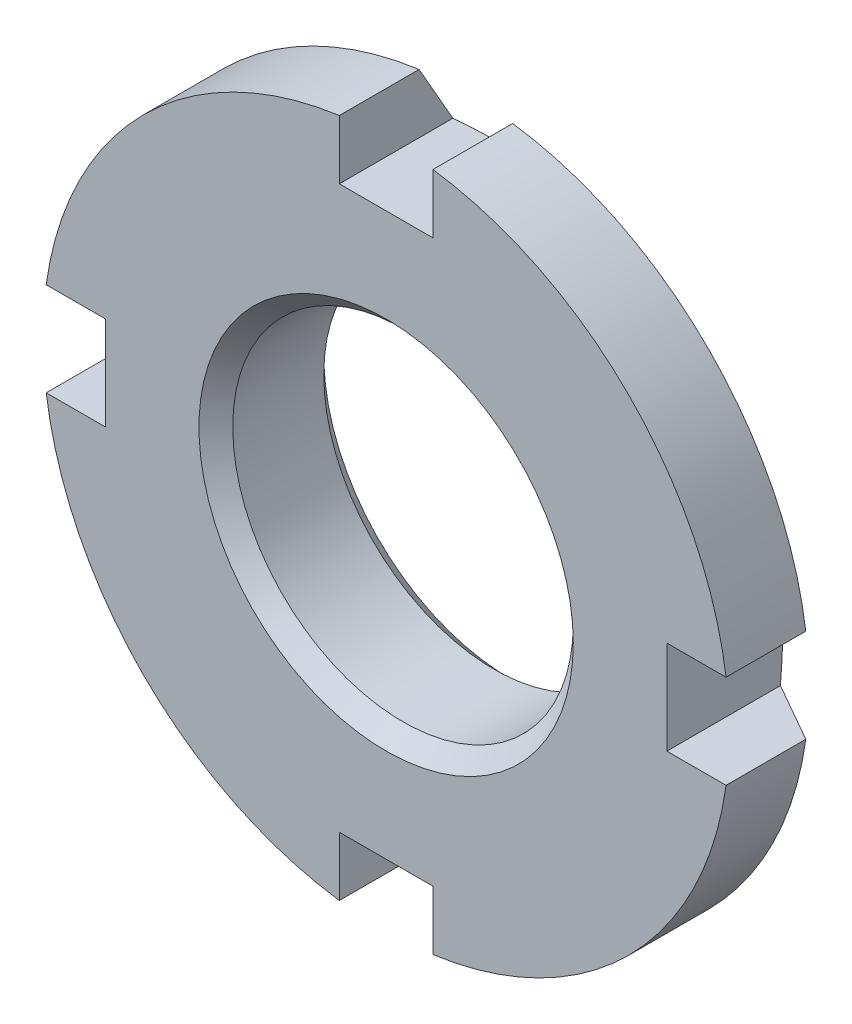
ISO-10303-21;
HEADER;
FILE_DESCRIPTION(('STEP AP214'),'2;1');
FILE_NAME('part.step','',(''),(''),'','','');
FILE_SCHEMA(('AUTOMOTIVE_DESIGN { 1 0 10303 214 1 1 1 1 }'));
ENDSEC;
DATA;
#1=APPLICATION_CONTEXT('core data for automotive mechanical design processes');
#2=APPLICATION_PROTOCOL_DEFINITION('international standard','automotive_design',2000,#1);
#3=PRODUCT_CONTEXT('',#1,'mechanical');
#4=PRODUCT('Part','Part','',(#3));
#5=PRODUCT_RELATED_PRODUCT_CATEGORY('part','',(#4));
#6=PRODUCT_DEFINITION_FORMATION('','',#4);
#7=PRODUCT_DEFINITION_CONTEXT('part definition',#1,'design');
#8=PRODUCT_DEFINITION('design','',#6,#7);
#9=PRODUCT_DEFINITION_SHAPE('','',#8);
#10=(LENGTH_UNIT() NAMED_UNIT(*) SI_UNIT(.MILLI.,.METRE.));
#11=(NAMED_UNIT(*) PLANE_ANGLE_UNIT() SI_UNIT($,.RADIAN.));
#12=(NAMED_UNIT(*) SI_UNIT($,.STERADIAN.) SOLID_ANGLE_UNIT());
#13=UNCERTAINTY_MEASURE_WITH_UNIT(LENGTH_MEASURE(1.E-05),#10,'distance_accuracy_value','');
#14=(GEOMETRIC_REPRESENTATION_CONTEXT(3) GLOBAL_UNCERTAINTY_ASSIGNED_CONTEXT((#13)) GLOBAL_UNIT_ASSIGNED_CONTEXT((#10,
#11,#12)) REPRESENTATION_CONTEXT('',''));
#15=CARTESIAN_POINT('',(0.,0.,0.));
#16=DIRECTION('',(0.,0.,1.));
#17=DIRECTION('',(1.,0.,0.));
#18=AXIS2_PLACEMENT_3D('',#15,#16,#17);
#19=CARTESIAN_POINT('',(0.,0.,-4.));
#20=DIRECTION('',(0.,0.,1.));
#21=DIRECTION('',(1.,0.,0.));
#22=AXIS2_PLACEMENT_3D('',#19,#20,#21);
#23=CYLINDRICAL_SURFACE('',#22,11.);
#24=DIRECTION('',(0.,0.,1.));
#25=VECTOR('',#24,1.);
#26=CARTESIAN_POINT('',(-1.5,10.8972473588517,-4.));
#27=LINE('',#26,#25);
#28=CARTESIAN_POINT('',(-1.5,10.8972473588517,-2.5566243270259));
#29=VERTEX_POINT('',#28);
#30=CARTESIAN_POINT('',(-1.5,10.8972473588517,0.));
#31=VERTEX_POINT('',#30);
#32=EDGE_CURVE('E228',#29,#31,#27,.T.);
#33=ORIENTED_EDGE('',*,*,#32,.F.);
#34=CARTESIAN_POINT('',(0.,0.,-2.5566243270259));
#35=DIRECTION('',(0.,0.,1.));
#36=DIRECTION('',(1.,0.,0.));
#37=AXIS2_PLACEMENT_3D('',#34,#35,#36);
#38=CIRCLE('',#37,11.);
#39=CARTESIAN_POINT('',(-10.8972473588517,1.5,-2.5566243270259));
#40=VERTEX_POINT('',#39);
#41=EDGE_CURVE('E235',#29,#40,#38,.T.);
#42=ORIENTED_EDGE('',*,*,#41,.T.);
#43=DIRECTION('',(0.,0.,1.));
#44=VECTOR('',#43,1.);
#45=CARTESIAN_POINT('',(-10.8972473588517,1.5,-4.));
#46=LINE('',#45,#44);
#47=CARTESIAN_POINT('',(-10.8972473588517,1.5,0.));
#48=VERTEX_POINT('',#47);
#49=EDGE_CURVE('E205',#48,#40,#46,.F.);
#50=ORIENTED_EDGE('',*,*,#49,.F.);
#51=CARTESIAN_POINT('',(0.,0.,0.));
#52=DIRECTION('',(0.,0.,1.));
#53=DIRECTION('',(1.,0.,0.));
#54=AXIS2_PLACEMENT_3D('',#51,#52,#53);
#55=CIRCLE('',#54,11.);
#56=EDGE_CURVE('E174',#31,#48,#55,.T.);
#57=ORIENTED_EDGE('',*,*,#56,.F.);
#58=EDGE_LOOP('',(#33,#42,#50,#57));
#59=FACE_BOUND('',#58,.T.);
#60=ADVANCED_FACE('F33',(#59),#23,.T.);
#61=DIRECTION('',(0.,0.,1.));
#62=VECTOR('',#61,1.);
#63=CARTESIAN_POINT('',(1.5,10.8972473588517,-4.));
#64=LINE('',#63,#62);
#65=CARTESIAN_POINT('',(1.5,10.8972473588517,0.));
#66=VERTEX_POINT('',#65);
#67=CARTESIAN_POINT('',(1.5,10.8972473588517,-2.5566243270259));
#68=VERTEX_POINT('',#67);
#69=EDGE_CURVE('E226',#66,#68,#64,.F.);
#70=ORIENTED_EDGE('',*,*,#69,.F.);
#71=CARTESIAN_POINT('',(10.8972473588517,1.5,0.));
#72=VERTEX_POINT('',#71);
#73=EDGE_CURVE('E251',#72,#66,#55,.T.);
#74=ORIENTED_EDGE('',*,*,#73,.F.);
#75=DIRECTION('',(0.,0.,1.));
#76=VECTOR('',#75,1.);
#77=CARTESIAN_POINT('',(10.8972473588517,1.5,-4.));
#78=LINE('',#77,#76);
#79=CARTESIAN_POINT('',(10.8972473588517,1.5,-2.5566243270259));
#80=VERTEX_POINT('',#79);
#81=EDGE_CURVE('E224',#80,#72,#78,.T.);
#82=ORIENTED_EDGE('',*,*,#81,.F.);
#83=EDGE_CURVE('E231',#80,#68,#38,.T.);
#84=ORIENTED_EDGE('',*,*,#83,.T.);
#85=EDGE_LOOP('',(#70,#74,#82,#84));
#86=FACE_BOUND('',#85,.T.);
#87=ADVANCED_FACE('F399',(#86),#23,.T.);
#88=DIRECTION('',(0.,0.,1.));
#89=VECTOR('',#88,1.);
#90=CARTESIAN_POINT('',(10.8972473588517,-1.5,-4.));
#91=LINE('',#90,#89);
#92=CARTESIAN_POINT('',(10.8972473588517,-1.5,0.));
#93=VERTEX_POINT('',#92);
#94=CARTESIAN_POINT('',(10.8972473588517,-1.5,-2.5566243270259));
#95=VERTEX_POINT('',#94);
#96=EDGE_CURVE('E52',#93,#95,#91,.F.);
#97=ORIENTED_EDGE('',*,*,#96,.F.);
#98=CARTESIAN_POINT('',(1.5,-10.8972473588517,0.));
#99=VERTEX_POINT('',#98);
#100=EDGE_CURVE('E250',#99,#93,#55,.T.);
#101=ORIENTED_EDGE('',*,*,#100,.F.);
#102=DIRECTION('',(0.,0.,1.));
#103=VECTOR('',#102,1.);
#104=CARTESIAN_POINT('',(1.5,-10.8972473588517,-4.));
#105=LINE('',#104,#103);
#106=CARTESIAN_POINT('',(1.5,-10.8972473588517,-2.5566243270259));
#107=VERTEX_POINT('',#106);
#108=EDGE_CURVE('E221',#107,#99,#105,.T.);
#109=ORIENTED_EDGE('',*,*,#108,.F.);
#110=EDGE_CURVE('E230',#107,#95,#38,.T.);
#111=ORIENTED_EDGE('',*,*,#110,.T.);
#112=EDGE_LOOP('',(#97,#101,#109,#111));
#113=FACE_BOUND('',#112,.T.);
#114=ADVANCED_FACE('F380',(#113),#23,.T.);
#115=DIRECTION('',(0.,0.,1.));
#116=VECTOR('',#115,1.);
#117=CARTESIAN_POINT('',(-1.5,-10.8972473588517,-4.));
#118=LINE('',#117,#116);
#119=CARTESIAN_POINT('',(-1.5,-10.8972473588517,0.));
#120=VERTEX_POINT('',#119);
#121=CARTESIAN_POINT('',(-1.5,-10.8972473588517,-2.5566243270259));
#122=VERTEX_POINT('',#121);
#123=EDGE_CURVE('E60',#120,#122,#118,.F.);
#124=ORIENTED_EDGE('',*,*,#123,.F.);
#125=CARTESIAN_POINT('',(-10.8972473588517,-1.5,0.));
#126=VERTEX_POINT('',#125);
#127=EDGE_CURVE('E372',#126,#120,#55,.T.);
#128=ORIENTED_EDGE('',*,*,#127,.F.);
#129=DIRECTION('',(0.,0.,1.));
#130=VECTOR('',#129,1.);
#131=CARTESIAN_POINT('',(-10.8972473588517,-1.5,-4.));
#132=LINE('',#131,#130);
#133=CARTESIAN_POINT('',(-10.8972473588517,-1.5,-2.5566243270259));
#134=VERTEX_POINT('',#133);
#135=EDGE_CURVE('E218',#134,#126,#132,.T.);
#136=ORIENTED_EDGE('',*,*,#135,.F.);
#137=EDGE_CURVE('E384',#134,#122,#38,.T.);
#138=ORIENTED_EDGE('',*,*,#137,.T.);
#139=EDGE_LOOP('',(#124,#128,#136,#138));
#140=FACE_BOUND('',#139,.T.);
#141=ADVANCED_FACE('F389',(#140),#23,.T.);
#142=CARTESIAN_POINT('',(0.,11.,0.));
#143=DIRECTION('',(0.,0.,-1.));
#144=DIRECTION('',(-1.,0.,0.));
#145=AXIS2_PLACEMENT_3D('',#142,#143,#144);
#146=PLANE('',#145);
#147=CARTESIAN_POINT('',(0.,0.,0.));
#148=DIRECTION('',(0.,0.,1.));
#149=DIRECTION('',(1.,0.,0.));
#150=AXIS2_PLACEMENT_3D('',#147,#148,#149);
#151=CIRCLE('',#150,6.);
#152=CARTESIAN_POINT('',(6.,0.,0.));
#153=VERTEX_POINT('',#152);
#154=EDGE_CURVE('E247',#153,#153,#151,.T.);
#155=ORIENTED_EDGE('',*,*,#154,.F.);
#156=EDGE_LOOP('',(#155));
#157=FACE_BOUND('',#156,.T.);
#158=DIRECTION('',(0.,1.,0.));
#159=VECTOR('',#158,1.);
#160=CARTESIAN_POINT('',(-1.5,9.,0.));
#161=LINE('',#160,#159);
#162=CARTESIAN_POINT('',(-1.5,9.,0.));
#163=VERTEX_POINT('',#162);
#164=EDGE_CURVE('E159',#163,#31,#161,.T.);
#165=ORIENTED_EDGE('',*,*,#164,.T.);
#166=ORIENTED_EDGE('',*,*,#56,.T.);
#167=DIRECTION('',(1.,0.,0.));
#168=VECTOR('',#167,1.);
#169=CARTESIAN_POINT('',(-16.856468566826,1.5,0.));
#170=LINE('',#169,#168);
#171=CARTESIAN_POINT('',(-9.,1.5,0.));
#172=VERTEX_POINT('',#171);
#173=EDGE_CURVE('E152',#48,#172,#170,.T.);
#174=ORIENTED_EDGE('',*,*,#173,.T.);
#175=DIRECTION('',(0.,-1.,0.));
#176=VECTOR('',#175,1.);
#177=CARTESIAN_POINT('',(-9.,1.5,0.));
#178=LINE('',#177,#176);
#179=CARTESIAN_POINT('',(-9.,-1.5,0.));
#180=VERTEX_POINT('',#179);
#181=EDGE_CURVE('E162',#172,#180,#178,.T.);
#182=ORIENTED_EDGE('',*,*,#181,.T.);
#183=DIRECTION('',(-1.,0.,0.));
#184=VECTOR('',#183,1.);
#185=CARTESIAN_POINT('',(-9.,-1.5,0.));
#186=LINE('',#185,#184);
#187=EDGE_CURVE('E168',#180,#126,#186,.T.);
#188=ORIENTED_EDGE('',*,*,#187,.T.);
#189=ORIENTED_EDGE('',*,*,#127,.T.);
#190=DIRECTION('',(0.,1.,0.));
#191=VECTOR('',#190,1.);
#192=CARTESIAN_POINT('',(-1.5,-16.856468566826,0.));
#193=LINE('',#192,#191);
#194=CARTESIAN_POINT('',(-1.5,-9.,0.));
#195=VERTEX_POINT('',#194);
#196=EDGE_CURVE('E178',#120,#195,#193,.T.);
#197=ORIENTED_EDGE('',*,*,#196,.T.);
#198=DIRECTION('',(1.,0.,0.));
#199=VECTOR('',#198,1.);
#200=CARTESIAN_POINT('',(-1.5,-9.,0.));
#201=LINE('',#200,#199);
#202=CARTESIAN_POINT('',(1.5,-9.,0.));
#203=VERTEX_POINT('',#202);
#204=EDGE_CURVE('E181',#195,#203,#201,.T.);
#205=ORIENTED_EDGE('',*,*,#204,.T.);
#206=DIRECTION('',(0.,-1.,0.));
#207=VECTOR('',#206,1.);
#208=CARTESIAN_POINT('',(1.5,-9.,0.));
#209=LINE('',#208,#207);
#210=EDGE_CURVE('E184',#203,#99,#209,.T.);
#211=ORIENTED_EDGE('',*,*,#210,.T.);
#212=ORIENTED_EDGE('',*,*,#100,.T.);
#213=DIRECTION('',(-1.,0.,0.));
#214=VECTOR('',#213,1.);
#215=CARTESIAN_POINT('',(16.856468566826,-1.5,0.));
#216=LINE('',#215,#214);
#217=CARTESIAN_POINT('',(9.,-1.5,0.));
#218=VERTEX_POINT('',#217);
#219=EDGE_CURVE('E187',#93,#218,#216,.T.);
#220=ORIENTED_EDGE('',*,*,#219,.T.);
#221=DIRECTION('',(0.,1.,0.));
#222=VECTOR('',#221,1.);
#223=CARTESIAN_POINT('',(9.,-1.5,0.));
#224=LINE('',#223,#222);
#225=CARTESIAN_POINT('',(9.,1.5,0.));
#226=VERTEX_POINT('',#225);
#227=EDGE_CURVE('E190',#218,#226,#224,.T.);
#228=ORIENTED_EDGE('',*,*,#227,.T.);
#229=DIRECTION('',(1.,0.,0.));
#230=VECTOR('',#229,1.);
#231=CARTESIAN_POINT('',(9.,1.5,0.));
#232=LINE('',#231,#230);
#233=EDGE_CURVE('E193',#226,#72,#232,.T.);
#234=ORIENTED_EDGE('',*,*,#233,.T.);
#235=ORIENTED_EDGE('',*,*,#73,.T.);
#236=DIRECTION('',(0.,-1.,0.));
#237=VECTOR('',#236,1.);
#238=CARTESIAN_POINT('',(1.5,16.856468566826,0.));
#239=LINE('',#238,#237);
#240=CARTESIAN_POINT('',(1.5,9.,0.));
#241=VERTEX_POINT('',#240);
#242=EDGE_CURVE('E196',#66,#241,#239,.T.);
#243=ORIENTED_EDGE('',*,*,#242,.T.);
#244=DIRECTION('',(-1.,0.,0.));
#245=VECTOR('',#244,1.);
#246=CARTESIAN_POINT('',(1.5,9.,0.));
#247=LINE('',#246,#245);
#248=EDGE_CURVE('E199',#241,#163,#247,.T.);
#249=ORIENTED_EDGE('',*,*,#248,.T.);
#250=EDGE_LOOP('',(#165,#166,#174,#182,#188,#189,#197,#205,#211,#212,#220,#228,#234,#235,#243,#249));
#251=FACE_BOUND('',#250,.T.);
#252=ADVANCED_FACE('F172',(#157,#251),#146,.F.);
#253=CARTESIAN_POINT('',(0.,0.,-4.));
#254=DIRECTION('',(0.,0.,1.));
#255=DIRECTION('',(1.,0.,0.));
#256=AXIS2_PLACEMENT_3D('',#253,#254,#255);
#257=CONICAL_SURFACE('',#256,8.5,1.04719755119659);
#258=CARTESIAN_POINT('',(0.,0.,-4.));
#259=DIRECTION('',(0.,0.,1.));
#260=DIRECTION('',(1.,0.,0.));
#261=AXIS2_PLACEMENT_3D('',#258,#259,#260);
#262=CIRCLE('',#261,8.5);
#263=CARTESIAN_POINT('',(8.5,0.,-4.));
#264=VERTEX_POINT('',#263);
#265=EDGE_CURVE('E234',#264,#264,#262,.T.);
#266=ORIENTED_EDGE('',*,*,#265,.T.);
#267=EDGE_LOOP('',(#266));
#268=FACE_BOUND('',#267,.T.);
#269=CARTESIAN_POINT('',(-1.5,5.08283849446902,-5.8477797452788));
#270=CARTESIAN_POINT('',(-1.5,5.2546733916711,-5.75261913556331));
#271=CARTESIAN_POINT('',(-1.5,5.42635183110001,-5.65717684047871));
#272=CARTESIAN_POINT('',(-1.5,5.76945578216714,-5.46583959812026));
#273=CARTESIAN_POINT('',(-1.5,5.94088129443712,-5.36994465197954));
#274=CARTESIAN_POINT('',(-1.5,6.45486741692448,-5.08174748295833));
#275=CARTESIAN_POINT('',(-1.5,6.79713991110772,-4.88893165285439));
#276=CARTESIAN_POINT('',(-1.5,7.48118882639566,-4.50243161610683));
#277=CARTESIAN_POINT('',(-1.5,7.82296525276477,-4.30874741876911));
#278=CARTESIAN_POINT('',(-1.5,8.506180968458,-3.92078391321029));
#279=CARTESIAN_POINT('',(-1.5,8.84762025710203,-3.72650460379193));
#280=CARTESIAN_POINT('',(-1.5,9.8715769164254,-3.1430527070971));
#281=CARTESIAN_POINT('',(-1.5,10.5537415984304,-2.75326132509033));
#282=CARTESIAN_POINT('',(-1.5,11.5766047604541,-2.16789644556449));
#283=CARTESIAN_POINT('',(-1.5,11.9174968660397,-1.97266087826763));
#284=CARTESIAN_POINT('',(-1.5,12.5991764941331,-1.58200767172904));
#285=CARTESIAN_POINT('',(-1.5,12.9399640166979,-1.38659003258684));
#286=CARTESIAN_POINT('',(-1.5,13.2807116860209,-1.19110286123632));
#287=B_SPLINE_CURVE_WITH_KNOTS('',3,(#269,#270,#271,#272,#273,#274,#275,#276,#277,#278,#279,
#280,#281,#282,#283,#284,#285,#286),.UNSPECIFIED.,.F.,.F.,(4,2,2,2,2,2,2,2,4),(0.,
0.589274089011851,1.1785467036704,2.35708404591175,3.53560878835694,4.71413590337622,
7.07116076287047,8.24968491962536,9.42820843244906),.UNSPECIFIED.);
#288=CARTESIAN_POINT('',(-1.5,9.,-3.63965041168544));
#289=VERTEX_POINT('',#288);
#290=EDGE_CURVE('E11',#289,#29,#287,.T.);
#291=ORIENTED_EDGE('',*,*,#290,.F.);
#292=CARTESIAN_POINT('',(3.77455551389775,9.,-3.27284422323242));
#293=CARTESIAN_POINT('',(3.57187424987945,9.,-3.31810832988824));
#294=CARTESIAN_POINT('',(3.36851305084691,9.,-3.36041234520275));
#295=CARTESIAN_POINT('',(2.96050767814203,9.,-3.43854623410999));
#296=CARTESIAN_POINT('',(2.75586323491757,9.,-3.474374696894));
#297=CARTESIAN_POINT('',(2.34524886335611,9.,-3.53901603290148));
#298=CARTESIAN_POINT('',(2.13927780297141,9.,-3.56782176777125));
#299=CARTESIAN_POINT('',(1.72642852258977,9.,-3.61786997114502));
#300=CARTESIAN_POINT('',(1.51955036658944,9.,-3.63911296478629));
#301=CARTESIAN_POINT('',(1.10946352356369,9.,-3.67327532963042));
#302=CARTESIAN_POINT('',(0.906268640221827,9.,-3.68635957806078));
#303=CARTESIAN_POINT('',(0.499508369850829,9.,-3.70464486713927));
#304=CARTESIAN_POINT('',(0.295942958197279,9.,-3.70984536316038));
#305=CARTESIAN_POINT('',(-0.111080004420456,9.,-3.71225631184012));
#306=CARTESIAN_POINT('',(-0.314537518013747,9.,-3.70947290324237));
#307=CARTESIAN_POINT('',(-0.721173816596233,9.,-3.69598764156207));
#308=CARTESIAN_POINT('',(-0.924352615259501,9.,-3.68528619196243));
#309=CARTESIAN_POINT('',(-1.40326587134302,9.,-3.65091869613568));
#310=CARTESIAN_POINT('',(-1.67877015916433,9.,-3.62397100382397));
#311=CARTESIAN_POINT('',(-2.22812888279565,9.,-3.55670158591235));
#312=CARTESIAN_POINT('',(-2.50198315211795,9.,-3.51637853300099));
#313=CARTESIAN_POINT('',(-3.32142302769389,9.,-3.37697925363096));
#314=CARTESIAN_POINT('',(-3.86394753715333,9.,-3.25954754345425));
#315=CARTESIAN_POINT('',(-4.67837736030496,9.,-3.05298840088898));
#316=CARTESIAN_POINT('',(-4.95400187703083,9.,-2.97772805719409));
#317=CARTESIAN_POINT('',(-5.50279280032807,9.,-2.81856665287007));
#318=CARTESIAN_POINT('',(-5.77595898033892,9.,-2.73466480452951));
#319=CARTESIAN_POINT('',(-6.31866075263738,9.,-2.55990870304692));
#320=CARTESIAN_POINT('',(-6.58820722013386,9.,-2.46908789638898));
#321=CARTESIAN_POINT('',(-7.12503506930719,9.,-2.28124506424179));
#322=CARTESIAN_POINT('',(-7.39231716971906,9.,-2.18422509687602));
#323=CARTESIAN_POINT('',(-7.65860782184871,9.,-2.08461684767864));
#324=B_SPLINE_CURVE_WITH_KNOTS('',3,(#292,#293,#294,#295,#296,#297,#298,#299,#300,#301,#302,
#303,#304,#305,#306,#307,#308,#309,#310,#311,#312,#313,#314,#315,#316,#317,#318,#319,#320,#321,
#322,#323),.UNSPECIFIED.,.F.,.F.,(4,2,2,2,2,2,2,2,2,2,2,2,2,2,2,4),(0.,0.623027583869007,
1.24619074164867,1.86998470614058,2.49373534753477,3.1044334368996,3.71517371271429,
4.32544452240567,4.93568423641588,5.76576105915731,6.59592027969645,8.25905133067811,
9.11611214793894,9.9732511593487,10.8264817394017,11.679430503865),.UNSPECIFIED.);
#325=CARTESIAN_POINT('',(1.5,9.,-3.63965041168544));
#326=VERTEX_POINT('',#325);
#327=EDGE_CURVE('E45',#326,#289,#324,.T.);
#328=ORIENTED_EDGE('',*,*,#327,.F.);
#329=CARTESIAN_POINT('',(1.5,13.2807116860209,-1.19110286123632));
#330=CARTESIAN_POINT('',(1.5,12.9399640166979,-1.38659003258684));
#331=CARTESIAN_POINT('',(1.5,12.5991764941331,-1.58200767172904));
#332=CARTESIAN_POINT('',(1.5,11.9174968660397,-1.97266087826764));
#333=CARTESIAN_POINT('',(1.5,11.5766047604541,-2.1678964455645));
#334=CARTESIAN_POINT('',(1.5,10.5537415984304,-2.75326132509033));
#335=CARTESIAN_POINT('',(1.5,9.8715769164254,-3.1430527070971));
#336=CARTESIAN_POINT('',(1.5,8.84762025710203,-3.72650460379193));
#337=CARTESIAN_POINT('',(1.5,8.50618096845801,-3.92078391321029));
#338=CARTESIAN_POINT('',(1.5,7.82296525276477,-4.3087474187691));
#339=CARTESIAN_POINT('',(1.5,7.48118882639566,-4.50243161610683));
#340=CARTESIAN_POINT('',(1.5,6.79713991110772,-4.88893165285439));
#341=CARTESIAN_POINT('',(1.5,6.45486741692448,-5.08174748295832));
#342=CARTESIAN_POINT('',(1.5,5.94088129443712,-5.36994465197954));
#343=CARTESIAN_POINT('',(1.5,5.76945578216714,-5.46583959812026));
#344=CARTESIAN_POINT('',(1.5,5.42635183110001,-5.65717684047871));
#345=CARTESIAN_POINT('',(1.5,5.2546733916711,-5.75261913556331));
#346=CARTESIAN_POINT('',(1.5,5.08283849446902,-5.8477797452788));
#347=B_SPLINE_CURVE_WITH_KNOTS('',3,(#329,#330,#331,#332,#333,#334,#335,#336,#337,#338,#339,
#340,#341,#342,#343,#344,#345,#346),.UNSPECIFIED.,.F.,.F.,(4,2,2,2,2,2,2,2,4),(0.,
1.1785235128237,2.35704766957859,4.71407252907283,5.89259964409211,7.07112438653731,
8.24966172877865,8.83893434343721,9.42820843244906),.UNSPECIFIED.);
#348=EDGE_CURVE('E334',#68,#326,#347,.T.);
#349=ORIENTED_EDGE('',*,*,#348,.F.);
#350=ORIENTED_EDGE('',*,*,#83,.F.);
#351=CARTESIAN_POINT('',(5.08283849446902,1.5,-5.8477797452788));
#352=CARTESIAN_POINT('',(5.2546733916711,1.5,-5.75261913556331));
#353=CARTESIAN_POINT('',(5.42635183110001,1.5,-5.65717684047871));
#354=CARTESIAN_POINT('',(5.76945578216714,1.5,-5.46583959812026));
#355=CARTESIAN_POINT('',(5.94088129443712,1.5,-5.36994465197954));
#356=CARTESIAN_POINT('',(6.45486741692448,1.5,-5.08174748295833));
#357=CARTESIAN_POINT('',(6.79713991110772,1.5,-4.88893165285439));
#358=CARTESIAN_POINT('',(7.48118882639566,1.5,-4.50243161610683));
#359=CARTESIAN_POINT('',(7.82296525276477,1.5,-4.30874741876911));
#360=CARTESIAN_POINT('',(8.506180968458,1.5,-3.92078391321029));
#361=CARTESIAN_POINT('',(8.84762025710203,1.5,-3.72650460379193));
#362=CARTESIAN_POINT('',(9.8715769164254,1.5,-3.1430527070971));
#363=CARTESIAN_POINT('',(10.5537415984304,1.5,-2.75326132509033));
#364=CARTESIAN_POINT('',(11.5766047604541,1.5,-2.16789644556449));
#365=CARTESIAN_POINT('',(11.9174968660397,1.5,-1.97266087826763));
#366=CARTESIAN_POINT('',(12.5991764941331,1.5,-1.58200767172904));
#367=CARTESIAN_POINT('',(12.9399640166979,1.5,-1.38659003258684));
#368=CARTESIAN_POINT('',(13.2807116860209,1.5,-1.19110286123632));
#369=B_SPLINE_CURVE_WITH_KNOTS('',3,(#351,#352,#353,#354,#355,#356,#357,#358,#359,#360,#361,
#362,#363,#364,#365,#366,#367,#368),.UNSPECIFIED.,.F.,.F.,(4,2,2,2,2,2,2,2,4),(0.,
0.589274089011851,1.1785467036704,2.35708404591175,3.53560878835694,4.71413590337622,
7.07116076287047,8.24968491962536,9.42820843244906),.UNSPECIFIED.);
#370=CARTESIAN_POINT('',(9.,1.5,-3.63965041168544));
#371=VERTEX_POINT('',#370);
#372=EDGE_CURVE('E329',#371,#80,#369,.T.);
#373=ORIENTED_EDGE('',*,*,#372,.F.);
#374=CARTESIAN_POINT('',(9.,-7.65860782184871,-2.08461684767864));
#375=CARTESIAN_POINT('',(9.,-7.39231716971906,-2.18422509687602));
#376=CARTESIAN_POINT('',(9.,-7.12503506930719,-2.28124506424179));
#377=CARTESIAN_POINT('',(9.,-6.58820722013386,-2.46908789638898));
#378=CARTESIAN_POINT('',(9.,-6.31866075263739,-2.55990870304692));
#379=CARTESIAN_POINT('',(9.,-5.77595898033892,-2.73466480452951));
#380=CARTESIAN_POINT('',(9.,-5.50279280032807,-2.81856665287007));
#381=CARTESIAN_POINT('',(9.,-4.95400187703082,-2.97772805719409));
#382=CARTESIAN_POINT('',(9.,-4.67837736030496,-3.05298840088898));
#383=CARTESIAN_POINT('',(9.,-3.86394753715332,-3.25954754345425));
#384=CARTESIAN_POINT('',(9.,-3.32142302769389,-3.37697925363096));
#385=CARTESIAN_POINT('',(9.,-2.50198315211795,-3.51637853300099));
#386=CARTESIAN_POINT('',(9.,-2.22812888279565,-3.55670158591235));
#387=CARTESIAN_POINT('',(9.,-1.67877015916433,-3.62397100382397));
#388=CARTESIAN_POINT('',(9.,-1.40326587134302,-3.65091869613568));
#389=CARTESIAN_POINT('',(9.,-0.924352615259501,-3.68528619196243));
#390=CARTESIAN_POINT('',(9.,-0.721173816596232,-3.69598764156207));
#391=CARTESIAN_POINT('',(9.,-0.314537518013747,-3.70947290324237));
#392=CARTESIAN_POINT('',(9.,-0.111080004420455,-3.71225631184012));
#393=CARTESIAN_POINT('',(9.,0.29594295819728,-3.70984536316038));
#394=CARTESIAN_POINT('',(9.,0.49950836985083,-3.70464486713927));
#395=CARTESIAN_POINT('',(9.,0.906268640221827,-3.68635957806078));
#396=CARTESIAN_POINT('',(9.,1.10946352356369,-3.67327532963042));
#397=CARTESIAN_POINT('',(9.,1.51955036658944,-3.63911296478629));
#398=CARTESIAN_POINT('',(9.,1.72642852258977,-3.61786997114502));
#399=CARTESIAN_POINT('',(9.,2.13927780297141,-3.56782176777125));
#400=CARTESIAN_POINT('',(9.,2.34524886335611,-3.53901603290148));
#401=CARTESIAN_POINT('',(9.,2.75586323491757,-3.474374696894));
#402=CARTESIAN_POINT('',(9.,2.96050767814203,-3.43854623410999));
#403=CARTESIAN_POINT('',(9.,3.36851305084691,-3.36041234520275));
#404=CARTESIAN_POINT('',(9.,3.57187424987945,-3.31810832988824));
#405=CARTESIAN_POINT('',(9.,3.77455551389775,-3.27284422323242));
#406=B_SPLINE_CURVE_WITH_KNOTS('',3,(#374,#375,#376,#377,#378,#379,#380,#381,#382,#383,#384,
#385,#386,#387,#388,#389,#390,#391,#392,#393,#394,#395,#396,#397,#398,#399,#400,#401,#402,#403,
#404,#405),.UNSPECIFIED.,.F.,.F.,(4,2,2,2,2,2,2,2,2,2,2,2,2,2,2,4),(0.,0.852948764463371,
1.70617934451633,2.5633183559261,3.42037917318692,5.08351022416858,5.91366944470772,
6.74374626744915,7.35398598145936,7.96425679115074,8.57499706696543,9.18569515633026,
9.80944579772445,10.4332397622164,11.056402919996,11.679430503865),.UNSPECIFIED.);
#407=CARTESIAN_POINT('',(9.,-1.5,-3.63965041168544));
#408=VERTEX_POINT('',#407);
#409=EDGE_CURVE('E324',#408,#371,#406,.T.);
#410=ORIENTED_EDGE('',*,*,#409,.F.);
#411=CARTESIAN_POINT('',(13.2807116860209,-1.5,-1.19110286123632));
#412=CARTESIAN_POINT('',(12.9399640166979,-1.5,-1.38659003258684));
#413=CARTESIAN_POINT('',(12.5991764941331,-1.5,-1.58200767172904));
#414=CARTESIAN_POINT('',(11.9174968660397,-1.5,-1.97266087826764));
#415=CARTESIAN_POINT('',(11.5766047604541,-1.5,-2.1678964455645));
#416=CARTESIAN_POINT('',(10.5537415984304,-1.5,-2.75326132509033));
#417=CARTESIAN_POINT('',(9.8715769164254,-1.5,-3.1430527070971));
#418=CARTESIAN_POINT('',(8.84762025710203,-1.5,-3.72650460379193));
#419=CARTESIAN_POINT('',(8.50618096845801,-1.5,-3.92078391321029));
#420=CARTESIAN_POINT('',(7.82296525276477,-1.5,-4.3087474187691));
#421=CARTESIAN_POINT('',(7.48118882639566,-1.5,-4.50243161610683));
#422=CARTESIAN_POINT('',(6.79713991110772,-1.5,-4.88893165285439));
#423=CARTESIAN_POINT('',(6.45486741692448,-1.5,-5.08174748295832));
#424=CARTESIAN_POINT('',(5.94088129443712,-1.5,-5.36994465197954));
#425=CARTESIAN_POINT('',(5.76945578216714,-1.5,-5.46583959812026));
#426=CARTESIAN_POINT('',(5.42635183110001,-1.5,-5.65717684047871));
#427=CARTESIAN_POINT('',(5.2546733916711,-1.5,-5.75261913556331));
#428=CARTESIAN_POINT('',(5.08283849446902,-1.5,-5.8477797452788));
#429=B_SPLINE_CURVE_WITH_KNOTS('',3,(#411,#412,#413,#414,#415,#416,#417,#418,#419,#420,#421,
#422,#423,#424,#425,#426,#427,#428),.UNSPECIFIED.,.F.,.F.,(4,2,2,2,2,2,2,2,4),(0.,
1.1785235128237,2.35704766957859,4.71407252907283,5.89259964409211,7.07112438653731,
8.24966172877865,8.83893434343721,9.42820843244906),.UNSPECIFIED.);
#430=EDGE_CURVE('E319',#95,#408,#429,.T.);
#431=ORIENTED_EDGE('',*,*,#430,.F.);
#432=ORIENTED_EDGE('',*,*,#110,.F.);
#433=CARTESIAN_POINT('',(1.5,-6.53219624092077,-5.03795588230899));
#434=CARTESIAN_POINT('',(1.5,-6.87454173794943,-4.84527796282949));
#435=CARTESIAN_POINT('',(1.5,-7.21659677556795,-4.6520855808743));
#436=CARTESIAN_POINT('',(1.5,-7.90027204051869,-4.26493435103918));
#437=CARTESIAN_POINT('',(1.5,-8.24189226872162,-4.0709755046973));
#438=CARTESIAN_POINT('',(1.5,-8.92484408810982,-3.68255377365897));
#439=CARTESIAN_POINT('',(1.5,-9.26617568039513,-3.48809089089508));
#440=CARTESIAN_POINT('',(1.5,-9.94862733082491,-3.09879387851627));
#441=CARTESIAN_POINT('',(1.5,-10.2897473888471,-2.90395974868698));
#442=CARTESIAN_POINT('',(1.5,-11.3128735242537,-2.3190545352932));
#443=CARTESIAN_POINT('',(1.5,-11.9946483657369,-1.92857903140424));
#444=CARTESIAN_POINT('',(1.5,-13.0170380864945,-1.34238779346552));
#445=CARTESIAN_POINT('',(1.5,-13.3577898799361,-1.14691068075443));
#446=CARTESIAN_POINT('',(1.5,-14.0392183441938,-0.755825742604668));
#447=CARTESIAN_POINT('',(1.5,-14.3798950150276,-0.560217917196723));
#448=CARTESIAN_POINT('',(1.5,-14.7205422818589,-0.36455887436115));
#449=B_SPLINE_CURVE_WITH_KNOTS('',3,(#433,#434,#435,#436,#437,#438,#439,#440,#441,#442,#443,
#444,#445,#446,#447,#448),.UNSPECIFIED.,.F.,.F.,(4,2,2,2,2,2,2,4),(0.,1.17852589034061,
2.35704941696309,3.53556843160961,4.71408812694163,7.07111784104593,8.24963715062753,
9.42815618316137),.UNSPECIFIED.);
#450=CARTESIAN_POINT('',(1.5,-9.,-3.63965041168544));
#451=VERTEX_POINT('',#450);
#452=EDGE_CURVE('E297',#451,#107,#449,.T.);
#453=ORIENTED_EDGE('',*,*,#452,.F.);
#454=CARTESIAN_POINT('',(-7.65860782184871,-9.,-2.08461684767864));
#455=CARTESIAN_POINT('',(-7.39231716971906,-9.,-2.18422509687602));
#456=CARTESIAN_POINT('',(-7.12503506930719,-9.,-2.28124506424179));
#457=CARTESIAN_POINT('',(-6.58820722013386,-9.,-2.46908789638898));
#458=CARTESIAN_POINT('',(-6.31866075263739,-9.,-2.55990870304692));
#459=CARTESIAN_POINT('',(-5.77595898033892,-9.,-2.73466480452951));
#460=CARTESIAN_POINT('',(-5.50279280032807,-9.,-2.81856665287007));
#461=CARTESIAN_POINT('',(-4.95400187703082,-9.,-2.97772805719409));
#462=CARTESIAN_POINT('',(-4.67837736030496,-9.,-3.05298840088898));
#463=CARTESIAN_POINT('',(-3.86394753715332,-9.,-3.25954754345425));
#464=CARTESIAN_POINT('',(-3.32142302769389,-9.,-3.37697925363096));
#465=CARTESIAN_POINT('',(-2.50198315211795,-9.,-3.51637853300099));
#466=CARTESIAN_POINT('',(-2.22812888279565,-9.,-3.55670158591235));
#467=CARTESIAN_POINT('',(-1.67877015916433,-9.,-3.62397100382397));
#468=CARTESIAN_POINT('',(-1.40326587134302,-9.,-3.65091869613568));
#469=CARTESIAN_POINT('',(-0.924352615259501,-9.,-3.68528619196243));
#470=CARTESIAN_POINT('',(-0.721173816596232,-9.,-3.69598764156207));
#471=CARTESIAN_POINT('',(-0.314537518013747,-9.,-3.70947290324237));
#472=CARTESIAN_POINT('',(-0.111080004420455,-9.,-3.71225631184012));
#473=CARTESIAN_POINT('',(0.29594295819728,-9.,-3.70984536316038));
#474=CARTESIAN_POINT('',(0.49950836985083,-9.,-3.70464486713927));
#475=CARTESIAN_POINT('',(0.906268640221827,-9.,-3.68635957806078));
#476=CARTESIAN_POINT('',(1.10946352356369,-9.,-3.67327532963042));
#477=CARTESIAN_POINT('',(1.51955036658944,-9.,-3.63911296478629));
#478=CARTESIAN_POINT('',(1.72642852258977,-9.,-3.61786997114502));
#479=CARTESIAN_POINT('',(2.13927780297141,-9.,-3.56782176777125));
#480=CARTESIAN_POINT('',(2.34524886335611,-9.,-3.53901603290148));
#481=CARTESIAN_POINT('',(2.75586323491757,-9.,-3.474374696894));
#482=CARTESIAN_POINT('',(2.96050767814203,-9.,-3.43854623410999));
#483=CARTESIAN_POINT('',(3.36851305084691,-9.,-3.36041234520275));
#484=CARTESIAN_POINT('',(3.57187424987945,-9.,-3.31810832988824));
#485=CARTESIAN_POINT('',(3.77455551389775,-9.,-3.27284422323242));
#486=B_SPLINE_CURVE_WITH_KNOTS('',3,(#454,#455,#456,#457,#458,#459,#460,#461,#462,#463,#464,
#465,#466,#467,#468,#469,#470,#471,#472,#473,#474,#475,#476,#477,#478,#479,#480,#481,#482,#483,
#484,#485),.UNSPECIFIED.,.F.,.F.,(4,2,2,2,2,2,2,2,2,2,2,2,2,2,2,4),(0.,0.852948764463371,
1.70617934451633,2.5633183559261,3.42037917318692,5.08351022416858,5.91366944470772,
6.74374626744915,7.35398598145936,7.96425679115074,8.57499706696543,9.18569515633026,
9.80944579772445,10.4332397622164,11.056402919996,11.679430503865),.UNSPECIFIED.);
#487=CARTESIAN_POINT('',(-1.5,-9.,-3.63965041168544));
#488=VERTEX_POINT('',#487);
#489=EDGE_CURVE('E292',#488,#451,#486,.T.);
#490=ORIENTED_EDGE('',*,*,#489,.F.);
#491=CARTESIAN_POINT('',(-1.5,-14.7205422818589,-0.36455887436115));
#492=CARTESIAN_POINT('',(-1.5,-14.3798950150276,-0.560217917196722));
#493=CARTESIAN_POINT('',(-1.5,-14.0392183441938,-0.755825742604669));
#494=CARTESIAN_POINT('',(-1.5,-13.3577898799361,-1.14691068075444));
#495=CARTESIAN_POINT('',(-1.5,-13.0170380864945,-1.34238779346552));
#496=CARTESIAN_POINT('',(-1.5,-11.9946483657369,-1.92857903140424));
#497=CARTESIAN_POINT('',(-1.5,-11.3128735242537,-2.3190545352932));
#498=CARTESIAN_POINT('',(-1.5,-10.2897473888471,-2.90395974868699));
#499=CARTESIAN_POINT('',(-1.5,-9.94862733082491,-3.09879387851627));
#500=CARTESIAN_POINT('',(-1.5,-9.26617568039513,-3.48809089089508));
#501=CARTESIAN_POINT('',(-1.5,-8.92484408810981,-3.68255377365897));
#502=CARTESIAN_POINT('',(-1.5,-8.24189226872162,-4.0709755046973));
#503=CARTESIAN_POINT('',(-1.5,-7.90027204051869,-4.26493435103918));
#504=CARTESIAN_POINT('',(-1.5,-7.21659677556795,-4.6520855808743));
#505=CARTESIAN_POINT('',(-1.5,-6.87454173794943,-4.84527796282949));
#506=CARTESIAN_POINT('',(-1.5,-6.53219624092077,-5.03795588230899));
#507=B_SPLINE_CURVE_WITH_KNOTS('',3,(#491,#492,#493,#494,#495,#496,#497,#498,#499,#500,#501,
#502,#503,#504,#505,#506),.UNSPECIFIED.,.F.,.F.,(4,2,2,2,2,2,2,4),(0.,1.17851903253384,
2.35703834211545,4.71406805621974,5.89258775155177,7.07110676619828,8.24963029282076,
9.42815618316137),.UNSPECIFIED.);
#508=EDGE_CURVE('E287',#122,#488,#507,.T.);
#509=ORIENTED_EDGE('',*,*,#508,.F.);
#510=ORIENTED_EDGE('',*,*,#137,.F.);
#511=CARTESIAN_POINT('',(-6.53219624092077,-1.5,-5.03795588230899));
#512=CARTESIAN_POINT('',(-6.87454173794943,-1.5,-4.84527796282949));
#513=CARTESIAN_POINT('',(-7.21659677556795,-1.5,-4.6520855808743));
#514=CARTESIAN_POINT('',(-7.90027204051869,-1.5,-4.26493435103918));
#515=CARTESIAN_POINT('',(-8.24189226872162,-1.5,-4.0709755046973));
#516=CARTESIAN_POINT('',(-8.92484408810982,-1.5,-3.68255377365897));
#517=CARTESIAN_POINT('',(-9.26617568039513,-1.5,-3.48809089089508));
#518=CARTESIAN_POINT('',(-9.94862733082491,-1.5,-3.09879387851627));
#519=CARTESIAN_POINT('',(-10.2897473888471,-1.5,-2.90395974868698));
#520=CARTESIAN_POINT('',(-11.3128735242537,-1.5,-2.3190545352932));
#521=CARTESIAN_POINT('',(-11.9946483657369,-1.5,-1.92857903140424));
#522=CARTESIAN_POINT('',(-13.0170380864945,-1.5,-1.34238779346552));
#523=CARTESIAN_POINT('',(-13.3577898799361,-1.5,-1.14691068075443));
#524=CARTESIAN_POINT('',(-14.0392183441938,-1.5,-0.755825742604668));
#525=CARTESIAN_POINT('',(-14.3798950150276,-1.5,-0.560217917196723));
#526=CARTESIAN_POINT('',(-14.7205422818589,-1.5,-0.36455887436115));
#527=B_SPLINE_CURVE_WITH_KNOTS('',3,(#511,#512,#513,#514,#515,#516,#517,#518,#519,#520,#521,
#522,#523,#524,#525,#526),.UNSPECIFIED.,.F.,.F.,(4,2,2,2,2,2,2,4),(0.,1.17852589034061,
2.35704941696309,3.53556843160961,4.71408812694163,7.07111784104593,8.24963715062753,
9.42815618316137),.UNSPECIFIED.);
#528=CARTESIAN_POINT('',(-9.,-1.5,-3.63965041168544));
#529=VERTEX_POINT('',#528);
#530=EDGE_CURVE('E282',#529,#134,#527,.T.);
#531=ORIENTED_EDGE('',*,*,#530,.F.);
#532=CARTESIAN_POINT('',(-9.,3.77455551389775,-3.27284422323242));
#533=CARTESIAN_POINT('',(-9.,3.57187424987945,-3.31810832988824));
#534=CARTESIAN_POINT('',(-9.,3.36851305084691,-3.36041234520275));
#535=CARTESIAN_POINT('',(-9.,2.96050767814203,-3.43854623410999));
#536=CARTESIAN_POINT('',(-9.,2.75586323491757,-3.474374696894));
#537=CARTESIAN_POINT('',(-9.,2.34524886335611,-3.53901603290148));
#538=CARTESIAN_POINT('',(-9.,2.13927780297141,-3.56782176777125));
#539=CARTESIAN_POINT('',(-9.,1.72642852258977,-3.61786997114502));
#540=CARTESIAN_POINT('',(-9.,1.51955036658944,-3.63911296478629));
#541=CARTESIAN_POINT('',(-9.,1.10946352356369,-3.67327532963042));
#542=CARTESIAN_POINT('',(-9.,0.906268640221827,-3.68635957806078));
#543=CARTESIAN_POINT('',(-9.,0.499508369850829,-3.70464486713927));
#544=CARTESIAN_POINT('',(-9.,0.295942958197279,-3.70984536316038));
#545=CARTESIAN_POINT('',(-9.,-0.111080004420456,-3.71225631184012));
#546=CARTESIAN_POINT('',(-9.,-0.314537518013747,-3.70947290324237));
#547=CARTESIAN_POINT('',(-9.,-0.721173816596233,-3.69598764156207));
#548=CARTESIAN_POINT('',(-9.,-0.924352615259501,-3.68528619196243));
#549=CARTESIAN_POINT('',(-9.,-1.40326587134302,-3.65091869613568));
#550=CARTESIAN_POINT('',(-9.,-1.67877015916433,-3.62397100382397));
#551=CARTESIAN_POINT('',(-9.,-2.22812888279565,-3.55670158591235));
#552=CARTESIAN_POINT('',(-9.,-2.50198315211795,-3.51637853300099));
#553=CARTESIAN_POINT('',(-9.,-3.32142302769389,-3.37697925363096));
#554=CARTESIAN_POINT('',(-9.,-3.86394753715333,-3.25954754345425));
#555=CARTESIAN_POINT('',(-9.,-4.67837736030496,-3.05298840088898));
#556=CARTESIAN_POINT('',(-9.,-4.95400187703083,-2.97772805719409));
#557=CARTESIAN_POINT('',(-9.,-5.50279280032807,-2.81856665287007));
#558=CARTESIAN_POINT('',(-9.,-5.77595898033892,-2.73466480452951));
#559=CARTESIAN_POINT('',(-9.,-6.31866075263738,-2.55990870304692));
#560=CARTESIAN_POINT('',(-9.,-6.58820722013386,-2.46908789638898));
#561=CARTESIAN_POINT('',(-9.,-7.12503506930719,-2.28124506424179));
#562=CARTESIAN_POINT('',(-9.,-7.39231716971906,-2.18422509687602));
#563=CARTESIAN_POINT('',(-9.,-7.65860782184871,-2.08461684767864));
#564=B_SPLINE_CURVE_WITH_KNOTS('',3,(#532,#533,#534,#535,#536,#537,#538,#539,#540,#541,#542,
#543,#544,#545,#546,#547,#548,#549,#550,#551,#552,#553,#554,#555,#556,#557,#558,#559,#560,#561,
#562,#563),.UNSPECIFIED.,.F.,.F.,(4,2,2,2,2,2,2,2,2,2,2,2,2,2,2,4),(0.,0.623027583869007,
1.24619074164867,1.86998470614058,2.49373534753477,3.1044334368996,3.71517371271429,
4.32544452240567,4.93568423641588,5.76576105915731,6.59592027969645,8.25905133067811,
9.11611214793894,9.9732511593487,10.8264817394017,11.679430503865),.UNSPECIFIED.);
#565=CARTESIAN_POINT('',(-9.,1.5,-3.63965041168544));
#566=VERTEX_POINT('',#565);
#567=EDGE_CURVE('E259',#566,#529,#564,.T.);
#568=ORIENTED_EDGE('',*,*,#567,.F.);
#569=CARTESIAN_POINT('',(-14.7205422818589,1.5,-0.36455887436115));
#570=CARTESIAN_POINT('',(-14.3798950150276,1.5,-0.560217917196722));
#571=CARTESIAN_POINT('',(-14.0392183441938,1.5,-0.755825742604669));
#572=CARTESIAN_POINT('',(-13.3577898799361,1.5,-1.14691068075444));
#573=CARTESIAN_POINT('',(-13.0170380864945,1.5,-1.34238779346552));
#574=CARTESIAN_POINT('',(-11.9946483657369,1.5,-1.92857903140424));
#575=CARTESIAN_POINT('',(-11.3128735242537,1.5,-2.3190545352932));
#576=CARTESIAN_POINT('',(-10.2897473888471,1.5,-2.90395974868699));
#577=CARTESIAN_POINT('',(-9.94862733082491,1.5,-3.09879387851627));
#578=CARTESIAN_POINT('',(-9.26617568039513,1.5,-3.48809089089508));
#579=CARTESIAN_POINT('',(-8.92484408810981,1.5,-3.68255377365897));
#580=CARTESIAN_POINT('',(-8.24189226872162,1.5,-4.0709755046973));
#581=CARTESIAN_POINT('',(-7.90027204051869,1.5,-4.26493435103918));
#582=CARTESIAN_POINT('',(-7.21659677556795,1.5,-4.6520855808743));
#583=CARTESIAN_POINT('',(-6.87454173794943,1.5,-4.84527796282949));
#584=CARTESIAN_POINT('',(-6.53219624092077,1.5,-5.03795588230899));
#585=B_SPLINE_CURVE_WITH_KNOTS('',3,(#569,#570,#571,#572,#573,#574,#575,#576,#577,#578,#579,
#580,#581,#582,#583,#584),.UNSPECIFIED.,.F.,.F.,(4,2,2,2,2,2,2,4),(0.,1.17851903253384,
2.35703834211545,4.71406805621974,5.89258775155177,7.07110676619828,8.24963029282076,
9.42815618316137),.UNSPECIFIED.);
#586=EDGE_CURVE('E155',#40,#566,#585,.T.);
#587=ORIENTED_EDGE('',*,*,#586,.F.);
#588=ORIENTED_EDGE('',*,*,#41,.F.);
#589=EDGE_LOOP('',(#291,#328,#349,#350,#373,#410,#431,#432,#453,#490,#509,#510,#531,#568,#587,#588));
#590=FACE_BOUND('',#589,.T.);
#591=ADVANCED_FACE('F265',(#268,#590),#257,.T.);
#592=CARTESIAN_POINT('',(0.,0.,0.));
#593=DIRECTION('',(0.,0.,1.));
#594=DIRECTION('',(1.,0.,0.));
#595=AXIS2_PLACEMENT_3D('',#592,#593,#594);
#596=CONICAL_SURFACE('',#595,6.,0.785398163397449);
#597=CARTESIAN_POINT('',(0.,0.,-0.5415));
#598=DIRECTION('',(0.,0.,1.));
#599=DIRECTION('',(1.,0.,0.));
#600=AXIS2_PLACEMENT_3D('',#597,#598,#599);
#601=CIRCLE('',#600,5.4585);
#602=CARTESIAN_POINT('',(5.4585,0.,-0.5415));
#603=VERTEX_POINT('',#602);
#604=EDGE_CURVE('E244',#603,#603,#601,.T.);
#605=ORIENTED_EDGE('',*,*,#604,.F.);
#606=EDGE_LOOP('',(#605));
#607=FACE_BOUND('',#606,.T.);
#608=ORIENTED_EDGE('',*,*,#154,.T.);
#609=EDGE_LOOP('',(#608));
#610=FACE_BOUND('',#609,.T.);
#611=ADVANCED_FACE('F450',(#607,#610),#596,.F.);
#612=CARTESIAN_POINT('',(0.,0.,-4.));
#613=DIRECTION('',(0.,0.,1.));
#614=DIRECTION('',(1.,0.,0.));
#615=AXIS2_PLACEMENT_3D('',#612,#613,#614);
#616=CYLINDRICAL_SURFACE('',#615,5.4585);
#617=CARTESIAN_POINT('',(0.,0.,-3.4585));
#618=DIRECTION('',(0.,0.,1.));
#619=DIRECTION('',(1.,0.,0.));
#620=AXIS2_PLACEMENT_3D('',#617,#618,#619);
#621=CIRCLE('',#620,5.4585);
#622=CARTESIAN_POINT('',(5.4585,0.,-3.4585));
#623=VERTEX_POINT('',#622);
#624=EDGE_CURVE('E241',#623,#623,#621,.T.);
#625=ORIENTED_EDGE('',*,*,#624,.F.);
#626=EDGE_LOOP('',(#625));
#627=FACE_BOUND('',#626,.T.);
#628=ORIENTED_EDGE('',*,*,#604,.T.);
#629=EDGE_LOOP('',(#628));
#630=FACE_BOUND('',#629,.T.);
#631=ADVANCED_FACE('F440',(#627,#630),#616,.F.);
#632=CARTESIAN_POINT('',(0.,0.,-3.4585));
#633=DIRECTION('',(0.,0.,-1.));
#634=DIRECTION('',(-1.,0.,0.));
#635=AXIS2_PLACEMENT_3D('',#632,#633,#634);
#636=CONICAL_SURFACE('',#635,5.4585,0.785398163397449);
#637=CARTESIAN_POINT('',(0.,0.,-4.));
#638=DIRECTION('',(0.,0.,1.));
#639=DIRECTION('',(1.,0.,0.));
#640=AXIS2_PLACEMENT_3D('',#637,#638,#639);
#641=CIRCLE('',#640,6.);
#642=CARTESIAN_POINT('',(6.,0.,-4.));
#643=VERTEX_POINT('',#642);
#644=EDGE_CURVE('E238',#643,#643,#641,.T.);
#645=ORIENTED_EDGE('',*,*,#644,.F.);
#646=EDGE_LOOP('',(#645));
#647=FACE_BOUND('',#646,.T.);
#648=ORIENTED_EDGE('',*,*,#624,.T.);
#649=EDGE_LOOP('',(#648));
#650=FACE_BOUND('',#649,.T.);
#651=ADVANCED_FACE('F430',(#647,#650),#636,.F.);
#652=CARTESIAN_POINT('',(0.,6.,-4.));
#653=DIRECTION('',(0.,0.,1.));
#654=DIRECTION('',(1.,0.,0.));
#655=AXIS2_PLACEMENT_3D('',#652,#653,#654);
#656=PLANE('',#655);
#657=ORIENTED_EDGE('',*,*,#265,.F.);
#658=EDGE_LOOP('',(#657));
#659=FACE_BOUND('',#658,.T.);
#660=ORIENTED_EDGE('',*,*,#644,.T.);
#661=EDGE_LOOP('',(#660));
#662=FACE_BOUND('',#661,.T.);
#663=ADVANCED_FACE('F270',(#659,#662),#656,.F.);
#664=CARTESIAN_POINT('',(-16.856468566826,1.5,-4.));
#665=DIRECTION('',(0.,-1.,0.));
#666=DIRECTION('',(0.,0.,-1.));
#667=AXIS2_PLACEMENT_3D('',#664,#665,#666);
#668=PLANE('',#667);
#669=ORIENTED_EDGE('',*,*,#49,.T.);
#670=ORIENTED_EDGE('',*,*,#586,.T.);
#671=DIRECTION('',(0.,0.,1.));
#672=VECTOR('',#671,1.);
#673=CARTESIAN_POINT('',(-9.,1.5,-4.));
#674=LINE('',#673,#672);
#675=EDGE_CURVE('E148',#566,#172,#674,.T.);
#676=ORIENTED_EDGE('',*,*,#675,.T.);
#677=ORIENTED_EDGE('',*,*,#173,.F.);
#678=EDGE_LOOP('',(#669,#670,#676,#677));
#679=FACE_BOUND('',#678,.T.);
#680=ADVANCED_FACE('F150',(#679),#668,.T.);
#681=CARTESIAN_POINT('',(-9.,1.5,-4.));
#682=DIRECTION('',(-1.,0.,0.));
#683=DIRECTION('',(0.,0.,1.));
#684=AXIS2_PLACEMENT_3D('',#681,#682,#683);
#685=PLANE('',#684);
#686=ORIENTED_EDGE('',*,*,#567,.T.);
#687=DIRECTION('',(0.,0.,1.));
#688=VECTOR('',#687,1.);
#689=CARTESIAN_POINT('',(-9.,-1.5,-4.));
#690=LINE('',#689,#688);
#691=EDGE_CURVE('E158',#529,#180,#690,.T.);
#692=ORIENTED_EDGE('',*,*,#691,.T.);
#693=ORIENTED_EDGE('',*,*,#181,.F.);
#694=ORIENTED_EDGE('',*,*,#675,.F.);
#695=EDGE_LOOP('',(#686,#692,#693,#694));
#696=FACE_BOUND('',#695,.T.);
#697=ADVANCED_FACE('F163',(#696),#685,.T.);
#698=CARTESIAN_POINT('',(-9.,-1.5,-4.));
#699=DIRECTION('',(0.,1.,0.));
#700=DIRECTION('',(0.,0.,1.));
#701=AXIS2_PLACEMENT_3D('',#698,#699,#700);
#702=PLANE('',#701);
#703=ORIENTED_EDGE('',*,*,#135,.T.);
#704=ORIENTED_EDGE('',*,*,#187,.F.);
#705=ORIENTED_EDGE('',*,*,#691,.F.);
#706=ORIENTED_EDGE('',*,*,#530,.T.);
#707=EDGE_LOOP('',(#703,#704,#705,#706));
#708=FACE_BOUND('',#707,.T.);
#709=ADVANCED_FACE('F274',(#708),#702,.T.);
#710=CARTESIAN_POINT('',(-1.5,-16.856468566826,-4.));
#711=DIRECTION('',(1.,0.,0.));
#712=DIRECTION('',(0.,0.,-1.));
#713=AXIS2_PLACEMENT_3D('',#710,#711,#712);
#714=PLANE('',#713);
#715=ORIENTED_EDGE('',*,*,#123,.T.);
#716=ORIENTED_EDGE('',*,*,#508,.T.);
#717=DIRECTION('',(0.,0.,1.));
#718=VECTOR('',#717,1.);
#719=CARTESIAN_POINT('',(-1.5,-9.,-4.));
#720=LINE('',#719,#718);
#721=EDGE_CURVE('E214',#488,#195,#720,.T.);
#722=ORIENTED_EDGE('',*,*,#721,.T.);
#723=ORIENTED_EDGE('',*,*,#196,.F.);
#724=EDGE_LOOP('',(#715,#716,#722,#723));
#725=FACE_BOUND('',#724,.T.);
#726=ADVANCED_FACE('F278',(#725),#714,.T.);
#727=CARTESIAN_POINT('',(-1.5,-9.,-4.));
#728=DIRECTION('',(0.,-1.,0.));
#729=DIRECTION('',(0.,0.,-1.));
#730=AXIS2_PLACEMENT_3D('',#727,#728,#729);
#731=PLANE('',#730);
#732=ORIENTED_EDGE('',*,*,#489,.T.);
#733=DIRECTION('',(0.,0.,1.));
#734=VECTOR('',#733,1.);
#735=CARTESIAN_POINT('',(1.5,-9.,-4.));
#736=LINE('',#735,#734);
#737=EDGE_CURVE('E212',#451,#203,#736,.T.);
#738=ORIENTED_EDGE('',*,*,#737,.T.);
#739=ORIENTED_EDGE('',*,*,#204,.F.);
#740=ORIENTED_EDGE('',*,*,#721,.F.);
#741=EDGE_LOOP('',(#732,#738,#739,#740));
#742=FACE_BOUND('',#741,.T.);
#743=ADVANCED_FACE('F303',(#742),#731,.T.);
#744=CARTESIAN_POINT('',(1.5,-9.,-4.));
#745=DIRECTION('',(-1.,0.,0.));
#746=DIRECTION('',(0.,0.,1.));
#747=AXIS2_PLACEMENT_3D('',#744,#745,#746);
#748=PLANE('',#747);
#749=ORIENTED_EDGE('',*,*,#108,.T.);
#750=ORIENTED_EDGE('',*,*,#210,.F.);
#751=ORIENTED_EDGE('',*,*,#737,.F.);
#752=ORIENTED_EDGE('',*,*,#452,.T.);
#753=EDGE_LOOP('',(#749,#750,#751,#752));
#754=FACE_BOUND('',#753,.T.);
#755=ADVANCED_FACE('F306',(#754),#748,.T.);
#756=CARTESIAN_POINT('',(16.856468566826,-1.5,-4.));
#757=DIRECTION('',(0.,1.,0.));
#758=DIRECTION('',(0.,0.,1.));
#759=AXIS2_PLACEMENT_3D('',#756,#757,#758);
#760=PLANE('',#759);
#761=ORIENTED_EDGE('',*,*,#96,.T.);
#762=ORIENTED_EDGE('',*,*,#430,.T.);
#763=DIRECTION('',(0.,0.,1.));
#764=VECTOR('',#763,1.);
#765=CARTESIAN_POINT('',(9.,-1.5,-4.));
#766=LINE('',#765,#764);
#767=EDGE_CURVE('E210',#408,#218,#766,.T.);
#768=ORIENTED_EDGE('',*,*,#767,.T.);
#769=ORIENTED_EDGE('',*,*,#219,.F.);
#770=EDGE_LOOP('',(#761,#762,#768,#769));
#771=FACE_BOUND('',#770,.T.);
#772=ADVANCED_FACE('F311',(#771),#760,.T.);
#773=CARTESIAN_POINT('',(9.,-1.5,-4.));
#774=DIRECTION('',(1.,0.,0.));
#775=DIRECTION('',(0.,0.,-1.));
#776=AXIS2_PLACEMENT_3D('',#773,#774,#775);
#777=PLANE('',#776);
#778=ORIENTED_EDGE('',*,*,#409,.T.);
#779=DIRECTION('',(0.,0.,1.));
#780=VECTOR('',#779,1.);
#781=CARTESIAN_POINT('',(9.,1.5,-4.));
#782=LINE('',#781,#780);
#783=EDGE_CURVE('E208',#371,#226,#782,.T.);
#784=ORIENTED_EDGE('',*,*,#783,.T.);
#785=ORIENTED_EDGE('',*,*,#227,.F.);
#786=ORIENTED_EDGE('',*,*,#767,.F.);
#787=EDGE_LOOP('',(#778,#784,#785,#786));
#788=FACE_BOUND('',#787,.T.);
#789=ADVANCED_FACE('F316',(#788),#777,.T.);
#790=CARTESIAN_POINT('',(9.,1.5,-4.));
#791=DIRECTION('',(0.,-1.,0.));
#792=DIRECTION('',(0.,0.,-1.));
#793=AXIS2_PLACEMENT_3D('',#790,#791,#792);
#794=PLANE('',#793);
#795=ORIENTED_EDGE('',*,*,#81,.T.);
#796=ORIENTED_EDGE('',*,*,#233,.F.);
#797=ORIENTED_EDGE('',*,*,#783,.F.);
#798=ORIENTED_EDGE('',*,*,#372,.T.);
#799=EDGE_LOOP('',(#795,#796,#797,#798));
#800=FACE_BOUND('',#799,.T.);
#801=ADVANCED_FACE('F339',(#800),#794,.T.);
#802=CARTESIAN_POINT('',(-1.5,9.,-4.));
#803=DIRECTION('',(1.,0.,0.));
#804=DIRECTION('',(0.,0.,-1.));
#805=AXIS2_PLACEMENT_3D('',#802,#803,#804);
#806=PLANE('',#805);
#807=ORIENTED_EDGE('',*,*,#32,.T.);
#808=ORIENTED_EDGE('',*,*,#164,.F.);
#809=DIRECTION('',(0.,0.,1.));
#810=VECTOR('',#809,1.);
#811=CARTESIAN_POINT('',(-1.5,9.,-4.));
#812=LINE('',#811,#810);
#813=EDGE_CURVE('E203',#289,#163,#812,.T.);
#814=ORIENTED_EDGE('',*,*,#813,.F.);
#815=ORIENTED_EDGE('',*,*,#290,.T.);
#816=EDGE_LOOP('',(#807,#808,#814,#815));
#817=FACE_BOUND('',#816,.T.);
#818=ADVANCED_FACE('F342',(#817),#806,.T.);
#819=CARTESIAN_POINT('',(1.5,9.,-4.));
#820=DIRECTION('',(0.,1.,0.));
#821=DIRECTION('',(0.,0.,1.));
#822=AXIS2_PLACEMENT_3D('',#819,#820,#821);
#823=PLANE('',#822);
#824=ORIENTED_EDGE('',*,*,#327,.T.);
#825=ORIENTED_EDGE('',*,*,#813,.T.);
#826=ORIENTED_EDGE('',*,*,#248,.F.);
#827=DIRECTION('',(0.,0.,1.));
#828=VECTOR('',#827,1.);
#829=CARTESIAN_POINT('',(1.5,9.,-4.));
#830=LINE('',#829,#828);
#831=EDGE_CURVE('E206',#326,#241,#830,.T.);
#832=ORIENTED_EDGE('',*,*,#831,.F.);
#833=EDGE_LOOP('',(#824,#825,#826,#832));
#834=FACE_BOUND('',#833,.T.);
#835=ADVANCED_FACE('F348',(#834),#823,.T.);
#836=CARTESIAN_POINT('',(1.5,16.856468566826,-4.));
#837=DIRECTION('',(-1.,0.,0.));
#838=DIRECTION('',(0.,0.,1.));
#839=AXIS2_PLACEMENT_3D('',#836,#837,#838);
#840=PLANE('',#839);
#841=ORIENTED_EDGE('',*,*,#69,.T.);
#842=ORIENTED_EDGE('',*,*,#348,.T.);
#843=ORIENTED_EDGE('',*,*,#831,.T.);
#844=ORIENTED_EDGE('',*,*,#242,.F.);
#845=EDGE_LOOP('',(#841,#842,#843,#844));
#846=FACE_BOUND('',#845,.T.);
#847=ADVANCED_FACE('F344',(#846),#840,.T.);
#848=CLOSED_SHELL('',(#60,#87,#114,#141,#252,#591,#611,#631,#651,#663,#680,#697,#709,#726,#743,
#755,#772,#789,#801,#818,#835,#847));
#849=MANIFOLD_SOLID_BREP('B2',#848);
#850=ADVANCED_BREP_SHAPE_REPRESENTATION('',(#18,#849),#14);
#851=SHAPE_DEFINITION_REPRESENTATION(#9,#850);
ENDSEC;
END-ISO-10303-21;
